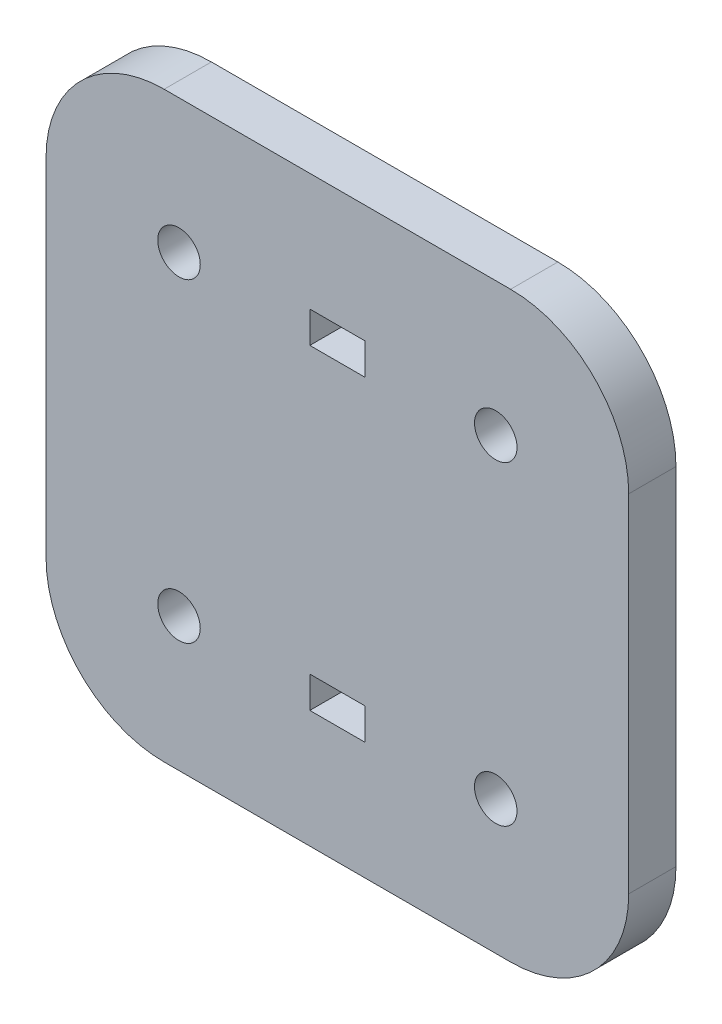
ISO-10303-21;
HEADER;
FILE_DESCRIPTION(('STEP AP214'),'2;1');
FILE_NAME('part.step','',(''),(''),'','','');
FILE_SCHEMA(('AUTOMOTIVE_DESIGN { 1 0 10303 214 1 1 1 1 }'));
ENDSEC;
DATA;
#1=APPLICATION_CONTEXT('core data for automotive mechanical design processes');
#2=APPLICATION_PROTOCOL_DEFINITION('international standard','automotive_design',2000,#1);
#3=PRODUCT_CONTEXT('',#1,'mechanical');
#4=PRODUCT('Part','Part','',(#3));
#5=PRODUCT_RELATED_PRODUCT_CATEGORY('part','',(#4));
#6=PRODUCT_DEFINITION_FORMATION('','',#4);
#7=PRODUCT_DEFINITION_CONTEXT('part definition',#1,'design');
#8=PRODUCT_DEFINITION('design','',#6,#7);
#9=PRODUCT_DEFINITION_SHAPE('','',#8);
#10=(LENGTH_UNIT() NAMED_UNIT(*) SI_UNIT(.MILLI.,.METRE.));
#11=(NAMED_UNIT(*) PLANE_ANGLE_UNIT() SI_UNIT($,.RADIAN.));
#12=(NAMED_UNIT(*) SI_UNIT($,.STERADIAN.) SOLID_ANGLE_UNIT());
#13=UNCERTAINTY_MEASURE_WITH_UNIT(LENGTH_MEASURE(1.E-05),#10,'distance_accuracy_value','');
#14=(GEOMETRIC_REPRESENTATION_CONTEXT(3) GLOBAL_UNCERTAINTY_ASSIGNED_CONTEXT((#13)) GLOBAL_UNIT_ASSIGNED_CONTEXT((#10,
#11,#12)) REPRESENTATION_CONTEXT('',''));
#15=CARTESIAN_POINT('',(0.,0.,0.));
#16=DIRECTION('',(0.,0.,1.));
#17=DIRECTION('',(1.,0.,0.));
#18=AXIS2_PLACEMENT_3D('',#15,#16,#17);
#19=CARTESIAN_POINT('',(-32.0000000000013,-115.404160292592,6.));
#20=DIRECTION('',(0.,0.,-1.));
#21=DIRECTION('',(-1.,0.,0.));
#22=AXIS2_PLACEMENT_3D('',#19,#20,#21);
#23=PLANE('',#22);
#24=CARTESIAN_POINT('',(-30.1133458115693,-113.404160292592,6.));
#25=DIRECTION('',(0.,0.,1.));
#26=DIRECTION('',(1.,0.,0.));
#27=AXIS2_PLACEMENT_3D('',#24,#25,#26);
#28=CIRCLE('',#27,2.70000000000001);
#29=CARTESIAN_POINT('',(-27.4133458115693,-113.404160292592,6.));
#30=VERTEX_POINT('',#29);
#31=EDGE_CURVE('E208',#30,#30,#28,.T.);
#32=ORIENTED_EDGE('',*,*,#31,.F.);
#33=EDGE_LOOP('',(#32));
#34=FACE_BOUND('',#33,.T.);
#35=CARTESIAN_POINT('',(10.1133458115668,-113.404160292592,6.));
#36=DIRECTION('',(0.,0.,1.));
#37=DIRECTION('',(1.,0.,0.));
#38=AXIS2_PLACEMENT_3D('',#35,#36,#37);
#39=CIRCLE('',#38,2.70000000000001);
#40=CARTESIAN_POINT('',(12.8133458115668,-113.404160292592,6.));
#41=VERTEX_POINT('',#40);
#42=EDGE_CURVE('E216',#41,#41,#39,.T.);
#43=ORIENTED_EDGE('',*,*,#42,.F.);
#44=EDGE_LOOP('',(#43));
#45=FACE_BOUND('',#44,.T.);
#46=CARTESIAN_POINT('',(10.113345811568,-73.4041602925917,6.));
#47=DIRECTION('',(0.,0.,1.));
#48=DIRECTION('',(1.,0.,0.));
#49=AXIS2_PLACEMENT_3D('',#46,#47,#48);
#50=CIRCLE('',#49,2.7);
#51=CARTESIAN_POINT('',(12.813345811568,-73.4041602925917,6.));
#52=VERTEX_POINT('',#51);
#53=EDGE_CURVE('E224',#52,#52,#50,.T.);
#54=ORIENTED_EDGE('',*,*,#53,.F.);
#55=EDGE_LOOP('',(#54));
#56=FACE_BOUND('',#55,.T.);
#57=DIRECTION('',(0.,1.,0.));
#58=VECTOR('',#57,1.);
#59=CARTESIAN_POINT('',(-6.50000000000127,-71.3307067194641,6.));
#60=LINE('',#59,#58);
#61=CARTESIAN_POINT('',(-6.50000000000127,-75.3307067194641,6.));
#62=VERTEX_POINT('',#61);
#63=CARTESIAN_POINT('',(-6.50000000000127,-71.3307067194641,6.));
#64=VERTEX_POINT('',#63);
#65=EDGE_CURVE('E235',#62,#64,#60,.T.);
#66=ORIENTED_EDGE('',*,*,#65,.F.);
#67=DIRECTION('',(1.,0.,0.));
#68=VECTOR('',#67,1.);
#69=CARTESIAN_POINT('',(-6.50000000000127,-75.3307067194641,6.));
#70=LINE('',#69,#68);
#71=CARTESIAN_POINT('',(-13.5000000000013,-75.3307067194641,6.));
#72=VERTEX_POINT('',#71);
#73=EDGE_CURVE('E232',#72,#62,#70,.T.);
#74=ORIENTED_EDGE('',*,*,#73,.F.);
#75=DIRECTION('',(0.,-1.,0.));
#76=VECTOR('',#75,1.);
#77=CARTESIAN_POINT('',(-13.5000000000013,-75.3307067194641,6.));
#78=LINE('',#77,#76);
#79=CARTESIAN_POINT('',(-13.5000000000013,-71.3307067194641,6.));
#80=VERTEX_POINT('',#79);
#81=EDGE_CURVE('E242',#80,#72,#78,.T.);
#82=ORIENTED_EDGE('',*,*,#81,.F.);
#83=DIRECTION('',(-1.,0.,0.));
#84=VECTOR('',#83,1.);
#85=CARTESIAN_POINT('',(-13.5000000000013,-71.3307067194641,6.));
#86=LINE('',#85,#84);
#87=EDGE_CURVE('E239',#64,#80,#86,.T.);
#88=ORIENTED_EDGE('',*,*,#87,.F.);
#89=EDGE_LOOP('',(#66,#74,#82,#88));
#90=FACE_BOUND('',#89,.T.);
#91=DIRECTION('',(0.,-1.,0.));
#92=VECTOR('',#91,1.);
#93=CARTESIAN_POINT('',(-47.0000000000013,-71.4041602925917,6.));
#94=LINE('',#93,#92);
#95=CARTESIAN_POINT('',(-47.0000000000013,-71.4041602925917,6.));
#96=VERTEX_POINT('',#95);
#97=CARTESIAN_POINT('',(-47.0000000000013,-115.404160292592,6.));
#98=VERTEX_POINT('',#97);
#99=EDGE_CURVE('E281',#96,#98,#94,.T.);
#100=ORIENTED_EDGE('',*,*,#99,.T.);
#101=CARTESIAN_POINT('',(-32.0000000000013,-115.404160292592,6.));
#102=DIRECTION('',(0.,0.,1.));
#103=DIRECTION('',(-1.,0.,0.));
#104=AXIS2_PLACEMENT_3D('',#101,#102,#103);
#105=CIRCLE('',#104,15.);
#106=CARTESIAN_POINT('',(-32.0000000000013,-130.404160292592,6.));
#107=VERTEX_POINT('',#106);
#108=EDGE_CURVE('E284',#98,#107,#105,.T.);
#109=ORIENTED_EDGE('',*,*,#108,.T.);
#110=DIRECTION('',(1.,0.,0.));
#111=VECTOR('',#110,1.);
#112=CARTESIAN_POINT('',(-32.0000000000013,-130.404160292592,6.));
#113=LINE('',#112,#111);
#114=CARTESIAN_POINT('',(11.9999999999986,-130.404160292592,6.));
#115=VERTEX_POINT('',#114);
#116=EDGE_CURVE('E288',#107,#115,#113,.T.);
#117=ORIENTED_EDGE('',*,*,#116,.T.);
#118=CARTESIAN_POINT('',(11.9999999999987,-115.404160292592,6.));
#119=DIRECTION('',(0.,0.,1.));
#120=DIRECTION('',(-1.,0.,0.));
#121=AXIS2_PLACEMENT_3D('',#118,#119,#120);
#122=CIRCLE('',#121,15.);
#123=CARTESIAN_POINT('',(26.9999999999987,-115.404160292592,6.));
#124=VERTEX_POINT('',#123);
#125=EDGE_CURVE('E291',#115,#124,#122,.T.);
#126=ORIENTED_EDGE('',*,*,#125,.T.);
#127=DIRECTION('',(0.,1.,0.));
#128=VECTOR('',#127,1.);
#129=CARTESIAN_POINT('',(26.9999999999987,-115.404160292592,6.));
#130=LINE('',#129,#128);
#131=CARTESIAN_POINT('',(26.9999999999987,-71.4041602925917,6.));
#132=VERTEX_POINT('',#131);
#133=EDGE_CURVE('E294',#124,#132,#130,.T.);
#134=ORIENTED_EDGE('',*,*,#133,.T.);
#135=CARTESIAN_POINT('',(11.9999999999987,-71.4041602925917,6.));
#136=DIRECTION('',(0.,0.,1.));
#137=DIRECTION('',(-1.,0.,0.));
#138=AXIS2_PLACEMENT_3D('',#135,#136,#137);
#139=CIRCLE('',#138,15.);
#140=CARTESIAN_POINT('',(11.9999999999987,-56.4041602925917,6.));
#141=VERTEX_POINT('',#140);
#142=EDGE_CURVE('E297',#132,#141,#139,.T.);
#143=ORIENTED_EDGE('',*,*,#142,.T.);
#144=DIRECTION('',(-1.,0.,0.));
#145=VECTOR('',#144,1.);
#146=CARTESIAN_POINT('',(11.9999999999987,-56.4041602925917,6.));
#147=LINE('',#146,#145);
#148=CARTESIAN_POINT('',(-32.0000000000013,-56.4041602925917,6.));
#149=VERTEX_POINT('',#148);
#150=EDGE_CURVE('E300',#141,#149,#147,.T.);
#151=ORIENTED_EDGE('',*,*,#150,.T.);
#152=CARTESIAN_POINT('',(-32.0000000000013,-71.4041602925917,6.));
#153=DIRECTION('',(0.,0.,1.));
#154=DIRECTION('',(1.,0.,0.));
#155=AXIS2_PLACEMENT_3D('',#152,#153,#154);
#156=CIRCLE('',#155,15.);
#157=EDGE_CURVE('E303',#149,#96,#156,.T.);
#158=ORIENTED_EDGE('',*,*,#157,.T.);
#159=EDGE_LOOP('',(#100,#109,#117,#126,#134,#143,#151,#158));
#160=FACE_BOUND('',#159,.T.);
#161=CARTESIAN_POINT('',(-30.1133458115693,-73.4041602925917,6.));
#162=DIRECTION('',(0.,0.,1.));
#163=DIRECTION('',(1.,0.,0.));
#164=AXIS2_PLACEMENT_3D('',#161,#162,#163);
#165=CIRCLE('',#164,2.7);
#166=CARTESIAN_POINT('',(-27.4133458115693,-73.4041602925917,6.));
#167=VERTEX_POINT('',#166);
#168=EDGE_CURVE('E273',#167,#167,#165,.T.);
#169=ORIENTED_EDGE('',*,*,#168,.F.);
#170=EDGE_LOOP('',(#169));
#171=FACE_BOUND('',#170,.T.);
#172=DIRECTION('',(1.,0.,0.));
#173=VECTOR('',#172,1.);
#174=CARTESIAN_POINT('',(-13.5000000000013,-115.477613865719,6.));
#175=LINE('',#174,#173);
#176=CARTESIAN_POINT('',(-13.5000000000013,-115.477613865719,6.));
#177=VERTEX_POINT('',#176);
#178=CARTESIAN_POINT('',(-6.50000000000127,-115.477613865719,6.));
#179=VERTEX_POINT('',#178);
#180=EDGE_CURVE('E159',#177,#179,#175,.T.);
#181=ORIENTED_EDGE('',*,*,#180,.F.);
#182=DIRECTION('',(0.,-1.,0.));
#183=VECTOR('',#182,1.);
#184=CARTESIAN_POINT('',(-13.5000000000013,-111.477613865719,6.));
#185=LINE('',#184,#183);
#186=CARTESIAN_POINT('',(-13.5000000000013,-111.477613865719,6.));
#187=VERTEX_POINT('',#186);
#188=EDGE_CURVE('E186',#187,#177,#185,.T.);
#189=ORIENTED_EDGE('',*,*,#188,.F.);
#190=DIRECTION('',(-1.,0.,0.));
#191=VECTOR('',#190,1.);
#192=CARTESIAN_POINT('',(-6.50000000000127,-111.477613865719,6.));
#193=LINE('',#192,#191);
#194=CARTESIAN_POINT('',(-6.50000000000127,-111.477613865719,6.));
#195=VERTEX_POINT('',#194);
#196=EDGE_CURVE('E182',#195,#187,#193,.T.);
#197=ORIENTED_EDGE('',*,*,#196,.F.);
#198=DIRECTION('',(0.,1.,0.));
#199=VECTOR('',#198,1.);
#200=CARTESIAN_POINT('',(-6.50000000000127,-115.477613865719,6.));
#201=LINE('',#200,#199);
#202=EDGE_CURVE('E168',#179,#195,#201,.T.);
#203=ORIENTED_EDGE('',*,*,#202,.F.);
#204=EDGE_LOOP('',(#181,#189,#197,#203));
#205=FACE_BOUND('',#204,.T.);
#206=ADVANCED_FACE('F45',(#34,#45,#56,#90,#160,#171,#205),#23,.F.);
#207=CARTESIAN_POINT('',(-32.0000000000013,-115.404160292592,0.));
#208=DIRECTION('',(0.,0.,-1.));
#209=DIRECTION('',(-1.,0.,0.));
#210=AXIS2_PLACEMENT_3D('',#207,#208,#209);
#211=PLANE('',#210);
#212=CARTESIAN_POINT('',(10.1133458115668,-113.404160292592,0.));
#213=DIRECTION('',(0.,0.,1.));
#214=DIRECTION('',(1.,0.,0.));
#215=AXIS2_PLACEMENT_3D('',#212,#213,#214);
#216=CIRCLE('',#215,2.70000000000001);
#217=CARTESIAN_POINT('',(12.8133458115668,-113.404160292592,0.));
#218=VERTEX_POINT('',#217);
#219=EDGE_CURVE('E212',#218,#218,#216,.T.);
#220=ORIENTED_EDGE('',*,*,#219,.T.);
#221=EDGE_LOOP('',(#220));
#222=FACE_BOUND('',#221,.T.);
#223=DIRECTION('',(1.,0.,0.));
#224=VECTOR('',#223,1.);
#225=CARTESIAN_POINT('',(-10.0000000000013,-75.3307067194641,0.));
#226=LINE('',#225,#224);
#227=CARTESIAN_POINT('',(-13.5000000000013,-75.3307067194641,0.));
#228=VERTEX_POINT('',#227);
#229=CARTESIAN_POINT('',(-6.50000000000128,-75.3307067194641,0.));
#230=VERTEX_POINT('',#229);
#231=EDGE_CURVE('E236',#228,#230,#226,.T.);
#232=ORIENTED_EDGE('',*,*,#231,.T.);
#233=DIRECTION('',(0.,1.,0.));
#234=VECTOR('',#233,1.);
#235=CARTESIAN_POINT('',(-6.50000000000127,-71.3307067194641,0.));
#236=LINE('',#235,#234);
#237=CARTESIAN_POINT('',(-6.50000000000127,-71.3307067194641,0.));
#238=VERTEX_POINT('',#237);
#239=EDGE_CURVE('E228',#230,#238,#236,.T.);
#240=ORIENTED_EDGE('',*,*,#239,.T.);
#241=DIRECTION('',(-1.,0.,0.));
#242=VECTOR('',#241,1.);
#243=CARTESIAN_POINT('',(-13.5000000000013,-71.3307067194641,0.));
#244=LINE('',#243,#242);
#245=CARTESIAN_POINT('',(-13.5000000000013,-71.3307067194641,0.));
#246=VERTEX_POINT('',#245);
#247=EDGE_CURVE('E250',#238,#246,#244,.T.);
#248=ORIENTED_EDGE('',*,*,#247,.T.);
#249=DIRECTION('',(0.,-1.,0.));
#250=VECTOR('',#249,1.);
#251=CARTESIAN_POINT('',(-13.5000000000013,-75.3307067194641,0.));
#252=LINE('',#251,#250);
#253=EDGE_CURVE('E254',#246,#228,#252,.T.);
#254=ORIENTED_EDGE('',*,*,#253,.T.);
#255=EDGE_LOOP('',(#232,#240,#248,#254));
#256=FACE_BOUND('',#255,.T.);
#257=CARTESIAN_POINT('',(-30.1133458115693,-73.4041602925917,0.));
#258=DIRECTION('',(0.,0.,1.));
#259=DIRECTION('',(1.,0.,0.));
#260=AXIS2_PLACEMENT_3D('',#257,#258,#259);
#261=CIRCLE('',#260,2.7);
#262=CARTESIAN_POINT('',(-27.4133458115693,-73.4041602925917,0.));
#263=VERTEX_POINT('',#262);
#264=EDGE_CURVE('E272',#263,#263,#261,.T.);
#265=ORIENTED_EDGE('',*,*,#264,.T.);
#266=EDGE_LOOP('',(#265));
#267=FACE_BOUND('',#266,.T.);
#268=DIRECTION('',(0.,-1.,0.));
#269=VECTOR('',#268,1.);
#270=CARTESIAN_POINT('',(-47.0000000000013,-93.4041602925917,0.));
#271=LINE('',#270,#269);
#272=CARTESIAN_POINT('',(-47.0000000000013,-71.4041602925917,0.));
#273=VERTEX_POINT('',#272);
#274=CARTESIAN_POINT('',(-47.0000000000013,-115.404160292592,0.));
#275=VERTEX_POINT('',#274);
#276=EDGE_CURVE('E277',#273,#275,#271,.T.);
#277=ORIENTED_EDGE('',*,*,#276,.F.);
#278=CARTESIAN_POINT('',(-32.0000000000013,-71.4041602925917,0.));
#279=DIRECTION('',(0.,0.,1.));
#280=DIRECTION('',(1.,0.,0.));
#281=AXIS2_PLACEMENT_3D('',#278,#279,#280);
#282=CIRCLE('',#281,15.);
#283=CARTESIAN_POINT('',(-32.0000000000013,-56.4041602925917,0.));
#284=VERTEX_POINT('',#283);
#285=EDGE_CURVE('E285',#284,#273,#282,.T.);
#286=ORIENTED_EDGE('',*,*,#285,.F.);
#287=DIRECTION('',(-1.,0.,0.));
#288=VECTOR('',#287,1.);
#289=CARTESIAN_POINT('',(11.9999999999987,-56.4041602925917,0.));
#290=LINE('',#289,#288);
#291=CARTESIAN_POINT('',(11.9999999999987,-56.4041602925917,0.));
#292=VERTEX_POINT('',#291);
#293=EDGE_CURVE('E324',#292,#284,#290,.T.);
#294=ORIENTED_EDGE('',*,*,#293,.F.);
#295=CARTESIAN_POINT('',(11.9999999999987,-71.4041602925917,0.));
#296=DIRECTION('',(0.,0.,1.));
#297=DIRECTION('',(-1.,0.,0.));
#298=AXIS2_PLACEMENT_3D('',#295,#296,#297);
#299=CIRCLE('',#298,15.);
#300=CARTESIAN_POINT('',(26.9999999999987,-71.4041602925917,0.));
#301=VERTEX_POINT('',#300);
#302=EDGE_CURVE('E321',#301,#292,#299,.T.);
#303=ORIENTED_EDGE('',*,*,#302,.F.);
#304=DIRECTION('',(0.,1.,0.));
#305=VECTOR('',#304,1.);
#306=CARTESIAN_POINT('',(26.9999999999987,-115.404160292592,0.));
#307=LINE('',#306,#305);
#308=CARTESIAN_POINT('',(26.9999999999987,-115.404160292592,0.));
#309=VERTEX_POINT('',#308);
#310=EDGE_CURVE('E318',#309,#301,#307,.T.);
#311=ORIENTED_EDGE('',*,*,#310,.F.);
#312=CARTESIAN_POINT('',(11.9999999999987,-115.404160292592,0.));
#313=DIRECTION('',(0.,0.,1.));
#314=DIRECTION('',(-1.,0.,0.));
#315=AXIS2_PLACEMENT_3D('',#312,#313,#314);
#316=CIRCLE('',#315,15.);
#317=CARTESIAN_POINT('',(11.9999999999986,-130.404160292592,0.));
#318=VERTEX_POINT('',#317);
#319=EDGE_CURVE('E315',#318,#309,#316,.T.);
#320=ORIENTED_EDGE('',*,*,#319,.F.);
#321=DIRECTION('',(1.,0.,0.));
#322=VECTOR('',#321,1.);
#323=CARTESIAN_POINT('',(-32.0000000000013,-130.404160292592,0.));
#324=LINE('',#323,#322);
#325=CARTESIAN_POINT('',(-32.0000000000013,-130.404160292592,0.));
#326=VERTEX_POINT('',#325);
#327=EDGE_CURVE('E312',#326,#318,#324,.T.);
#328=ORIENTED_EDGE('',*,*,#327,.F.);
#329=CARTESIAN_POINT('',(-32.0000000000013,-115.404160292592,0.));
#330=DIRECTION('',(0.,0.,1.));
#331=DIRECTION('',(-1.,0.,0.));
#332=AXIS2_PLACEMENT_3D('',#329,#330,#331);
#333=CIRCLE('',#332,15.);
#334=EDGE_CURVE('E309',#275,#326,#333,.T.);
#335=ORIENTED_EDGE('',*,*,#334,.F.);
#336=EDGE_LOOP('',(#277,#286,#294,#303,#311,#320,#328,#335));
#337=FACE_BOUND('',#336,.T.);
#338=CARTESIAN_POINT('',(10.113345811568,-73.4041602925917,0.));
#339=DIRECTION('',(0.,0.,1.));
#340=DIRECTION('',(1.,0.,0.));
#341=AXIS2_PLACEMENT_3D('',#338,#339,#340);
#342=CIRCLE('',#341,2.7);
#343=CARTESIAN_POINT('',(12.813345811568,-73.4041602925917,0.));
#344=VERTEX_POINT('',#343);
#345=EDGE_CURVE('E220',#344,#344,#342,.T.);
#346=ORIENTED_EDGE('',*,*,#345,.T.);
#347=EDGE_LOOP('',(#346));
#348=FACE_BOUND('',#347,.T.);
#349=CARTESIAN_POINT('',(-30.1133458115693,-113.404160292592,0.));
#350=DIRECTION('',(0.,0.,1.));
#351=DIRECTION('',(1.,0.,0.));
#352=AXIS2_PLACEMENT_3D('',#349,#350,#351);
#353=CIRCLE('',#352,2.70000000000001);
#354=CARTESIAN_POINT('',(-27.4133458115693,-113.404160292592,0.));
#355=VERTEX_POINT('',#354);
#356=EDGE_CURVE('E178',#355,#355,#353,.T.);
#357=ORIENTED_EDGE('',*,*,#356,.T.);
#358=EDGE_LOOP('',(#357));
#359=FACE_BOUND('',#358,.T.);
#360=DIRECTION('',(0.,-1.,0.));
#361=VECTOR('',#360,1.);
#362=CARTESIAN_POINT('',(-13.5000000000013,-111.477613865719,0.));
#363=LINE('',#362,#361);
#364=CARTESIAN_POINT('',(-13.5000000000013,-111.477613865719,0.));
#365=VERTEX_POINT('',#364);
#366=CARTESIAN_POINT('',(-13.5000000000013,-115.477613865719,0.));
#367=VERTEX_POINT('',#366);
#368=EDGE_CURVE('E169',#365,#367,#363,.T.);
#369=ORIENTED_EDGE('',*,*,#368,.T.);
#370=DIRECTION('',(1.,0.,0.));
#371=VECTOR('',#370,1.);
#372=CARTESIAN_POINT('',(-13.5000000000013,-115.477613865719,0.));
#373=LINE('',#372,#371);
#374=CARTESIAN_POINT('',(-6.50000000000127,-115.477613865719,0.));
#375=VERTEX_POINT('',#374);
#376=EDGE_CURVE('E69',#367,#375,#373,.T.);
#377=ORIENTED_EDGE('',*,*,#376,.T.);
#378=DIRECTION('',(0.,1.,0.));
#379=VECTOR('',#378,1.);
#380=CARTESIAN_POINT('',(-6.50000000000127,-115.477613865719,0.));
#381=LINE('',#380,#379);
#382=CARTESIAN_POINT('',(-6.50000000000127,-111.477613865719,0.));
#383=VERTEX_POINT('',#382);
#384=EDGE_CURVE('E176',#375,#383,#381,.T.);
#385=ORIENTED_EDGE('',*,*,#384,.T.);
#386=DIRECTION('',(-1.,0.,0.));
#387=VECTOR('',#386,1.);
#388=CARTESIAN_POINT('',(-10.0000000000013,-111.477613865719,0.));
#389=LINE('',#388,#387);
#390=EDGE_CURVE('E195',#383,#365,#389,.T.);
#391=ORIENTED_EDGE('',*,*,#390,.T.);
#392=EDGE_LOOP('',(#369,#377,#385,#391));
#393=FACE_BOUND('',#392,.T.);
#394=ADVANCED_FACE('F365',(#222,#256,#267,#337,#348,#359,#393),#211,.T.);
#395=CARTESIAN_POINT('',(-47.0000000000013,-93.4041602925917,6.));
#396=DIRECTION('',(1.,0.,0.));
#397=DIRECTION('',(0.,1.,0.));
#398=AXIS2_PLACEMENT_3D('',#395,#396,#397);
#399=PLANE('',#398);
#400=ORIENTED_EDGE('',*,*,#276,.T.);
#401=DIRECTION('',(0.,0.,-1.));
#402=VECTOR('',#401,1.);
#403=CARTESIAN_POINT('',(-47.0000000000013,-115.404160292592,6.));
#404=LINE('',#403,#402);
#405=EDGE_CURVE('E11',#98,#275,#404,.T.);
#406=ORIENTED_EDGE('',*,*,#405,.F.);
#407=ORIENTED_EDGE('',*,*,#99,.F.);
#408=DIRECTION('',(0.,0.,-1.));
#409=VECTOR('',#408,1.);
#410=CARTESIAN_POINT('',(-47.0000000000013,-71.4041602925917,6.));
#411=LINE('',#410,#409);
#412=EDGE_CURVE('E306',#96,#273,#411,.T.);
#413=ORIENTED_EDGE('',*,*,#412,.T.);
#414=EDGE_LOOP('',(#400,#406,#407,#413));
#415=FACE_BOUND('',#414,.T.);
#416=ADVANCED_FACE('F47',(#415),#399,.F.);
#417=CARTESIAN_POINT('',(-32.0000000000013,-115.404160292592,6.));
#418=DIRECTION('',(0.,0.,-1.));
#419=DIRECTION('',(-1.,0.,0.));
#420=AXIS2_PLACEMENT_3D('',#417,#418,#419);
#421=CYLINDRICAL_SURFACE('',#420,15.);
#422=ORIENTED_EDGE('',*,*,#334,.T.);
#423=DIRECTION('',(0.,0.,-1.));
#424=VECTOR('',#423,1.);
#425=CARTESIAN_POINT('',(-32.0000000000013,-130.404160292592,6.));
#426=LINE('',#425,#424);
#427=EDGE_CURVE('E54',#107,#326,#426,.T.);
#428=ORIENTED_EDGE('',*,*,#427,.F.);
#429=ORIENTED_EDGE('',*,*,#108,.F.);
#430=ORIENTED_EDGE('',*,*,#405,.T.);
#431=EDGE_LOOP('',(#422,#428,#429,#430));
#432=FACE_BOUND('',#431,.T.);
#433=ADVANCED_FACE('F383',(#432),#421,.T.);
#434=CARTESIAN_POINT('',(-32.0000000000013,-130.404160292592,6.));
#435=DIRECTION('',(0.,1.,0.));
#436=DIRECTION('',(-1.,0.,0.));
#437=AXIS2_PLACEMENT_3D('',#434,#435,#436);
#438=PLANE('',#437);
#439=ORIENTED_EDGE('',*,*,#327,.T.);
#440=DIRECTION('',(0.,0.,-1.));
#441=VECTOR('',#440,1.);
#442=CARTESIAN_POINT('',(11.9999999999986,-130.404160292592,6.));
#443=LINE('',#442,#441);
#444=EDGE_CURVE('E349',#115,#318,#443,.T.);
#445=ORIENTED_EDGE('',*,*,#444,.F.);
#446=ORIENTED_EDGE('',*,*,#116,.F.);
#447=ORIENTED_EDGE('',*,*,#427,.T.);
#448=EDGE_LOOP('',(#439,#445,#446,#447));
#449=FACE_BOUND('',#448,.T.);
#450=ADVANCED_FACE('F358',(#449),#438,.F.);
#451=CARTESIAN_POINT('',(11.9999999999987,-115.404160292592,6.));
#452=DIRECTION('',(0.,0.,-1.));
#453=DIRECTION('',(-1.,0.,0.));
#454=AXIS2_PLACEMENT_3D('',#451,#452,#453);
#455=CYLINDRICAL_SURFACE('',#454,15.);
#456=ORIENTED_EDGE('',*,*,#319,.T.);
#457=DIRECTION('',(0.,0.,-1.));
#458=VECTOR('',#457,1.);
#459=CARTESIAN_POINT('',(26.9999999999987,-115.404160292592,6.));
#460=LINE('',#459,#458);
#461=EDGE_CURVE('E345',#124,#309,#460,.T.);
#462=ORIENTED_EDGE('',*,*,#461,.F.);
#463=ORIENTED_EDGE('',*,*,#125,.F.);
#464=ORIENTED_EDGE('',*,*,#444,.T.);
#465=EDGE_LOOP('',(#456,#462,#463,#464));
#466=FACE_BOUND('',#465,.T.);
#467=ADVANCED_FACE('F371',(#466),#455,.T.);
#468=CARTESIAN_POINT('',(26.9999999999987,-115.404160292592,6.));
#469=DIRECTION('',(-1.,0.,0.));
#470=DIRECTION('',(0.,-1.,0.));
#471=AXIS2_PLACEMENT_3D('',#468,#469,#470);
#472=PLANE('',#471);
#473=ORIENTED_EDGE('',*,*,#310,.T.);
#474=DIRECTION('',(0.,0.,-1.));
#475=VECTOR('',#474,1.);
#476=CARTESIAN_POINT('',(26.9999999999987,-71.4041602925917,6.));
#477=LINE('',#476,#475);
#478=EDGE_CURVE('E341',#132,#301,#477,.T.);
#479=ORIENTED_EDGE('',*,*,#478,.F.);
#480=ORIENTED_EDGE('',*,*,#133,.F.);
#481=ORIENTED_EDGE('',*,*,#461,.T.);
#482=EDGE_LOOP('',(#473,#479,#480,#481));
#483=FACE_BOUND('',#482,.T.);
#484=ADVANCED_FACE('F375',(#483),#472,.F.);
#485=CARTESIAN_POINT('',(11.9999999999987,-71.4041602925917,6.));
#486=DIRECTION('',(0.,0.,-1.));
#487=DIRECTION('',(-1.,0.,0.));
#488=AXIS2_PLACEMENT_3D('',#485,#486,#487);
#489=CYLINDRICAL_SURFACE('',#488,15.);
#490=ORIENTED_EDGE('',*,*,#302,.T.);
#491=DIRECTION('',(0.,0.,-1.));
#492=VECTOR('',#491,1.);
#493=CARTESIAN_POINT('',(11.9999999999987,-56.4041602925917,6.));
#494=LINE('',#493,#492);
#495=EDGE_CURVE('E337',#141,#292,#494,.T.);
#496=ORIENTED_EDGE('',*,*,#495,.F.);
#497=ORIENTED_EDGE('',*,*,#142,.F.);
#498=ORIENTED_EDGE('',*,*,#478,.T.);
#499=EDGE_LOOP('',(#490,#496,#497,#498));
#500=FACE_BOUND('',#499,.T.);
#501=ADVANCED_FACE('F396',(#500),#489,.T.);
#502=CARTESIAN_POINT('',(11.9999999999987,-56.4041602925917,6.));
#503=DIRECTION('',(0.,-1.,0.));
#504=DIRECTION('',(0.,0.,-1.));
#505=AXIS2_PLACEMENT_3D('',#502,#503,#504);
#506=PLANE('',#505);
#507=ORIENTED_EDGE('',*,*,#293,.T.);
#508=DIRECTION('',(0.,0.,-1.));
#509=VECTOR('',#508,1.);
#510=CARTESIAN_POINT('',(-32.0000000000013,-56.4041602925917,6.));
#511=LINE('',#510,#509);
#512=EDGE_CURVE('E333',#149,#284,#511,.T.);
#513=ORIENTED_EDGE('',*,*,#512,.F.);
#514=ORIENTED_EDGE('',*,*,#150,.F.);
#515=ORIENTED_EDGE('',*,*,#495,.T.);
#516=EDGE_LOOP('',(#507,#513,#514,#515));
#517=FACE_BOUND('',#516,.T.);
#518=ADVANCED_FACE('F394',(#517),#506,.F.);
#519=CARTESIAN_POINT('',(-32.0000000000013,-71.4041602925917,6.));
#520=DIRECTION('',(0.,0.,-1.));
#521=DIRECTION('',(-1.,0.,0.));
#522=AXIS2_PLACEMENT_3D('',#519,#520,#521);
#523=CYLINDRICAL_SURFACE('',#522,15.);
#524=ORIENTED_EDGE('',*,*,#285,.T.);
#525=ORIENTED_EDGE('',*,*,#412,.F.);
#526=ORIENTED_EDGE('',*,*,#157,.F.);
#527=ORIENTED_EDGE('',*,*,#512,.T.);
#528=EDGE_LOOP('',(#524,#525,#526,#527));
#529=FACE_BOUND('',#528,.T.);
#530=ADVANCED_FACE('F389',(#529),#523,.T.);
#531=CARTESIAN_POINT('',(-30.1133458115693,-73.4041602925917,6.));
#532=DIRECTION('',(0.,0.,-1.));
#533=DIRECTION('',(-1.,0.,0.));
#534=AXIS2_PLACEMENT_3D('',#531,#532,#533);
#535=CYLINDRICAL_SURFACE('',#534,2.7);
#536=ORIENTED_EDGE('',*,*,#168,.T.);
#537=EDGE_LOOP('',(#536));
#538=FACE_BOUND('',#537,.T.);
#539=ORIENTED_EDGE('',*,*,#264,.F.);
#540=EDGE_LOOP('',(#539));
#541=FACE_BOUND('',#540,.T.);
#542=ADVANCED_FACE('F416',(#538,#541),#535,.F.);
#543=CARTESIAN_POINT('',(-6.50000000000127,-71.3307067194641,6.));
#544=DIRECTION('',(-1.,0.,0.));
#545=DIRECTION('',(0.,0.,1.));
#546=AXIS2_PLACEMENT_3D('',#543,#544,#545);
#547=PLANE('',#546);
#548=ORIENTED_EDGE('',*,*,#239,.F.);
#549=DIRECTION('',(0.,0.,-1.));
#550=VECTOR('',#549,1.);
#551=CARTESIAN_POINT('',(-6.50000000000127,-75.3307067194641,6.));
#552=LINE('',#551,#550);
#553=EDGE_CURVE('E269',#62,#230,#552,.T.);
#554=ORIENTED_EDGE('',*,*,#553,.F.);
#555=ORIENTED_EDGE('',*,*,#65,.T.);
#556=DIRECTION('',(0.,0.,-1.));
#557=VECTOR('',#556,1.);
#558=CARTESIAN_POINT('',(-6.50000000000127,-71.3307067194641,6.));
#559=LINE('',#558,#557);
#560=EDGE_CURVE('E266',#64,#238,#559,.T.);
#561=ORIENTED_EDGE('',*,*,#560,.T.);
#562=EDGE_LOOP('',(#548,#554,#555,#561));
#563=FACE_BOUND('',#562,.T.);
#564=ADVANCED_FACE('F423',(#563),#547,.T.);
#565=CARTESIAN_POINT('',(-13.5000000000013,-71.3307067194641,6.));
#566=DIRECTION('',(0.,-1.,0.));
#567=DIRECTION('',(0.,0.,-1.));
#568=AXIS2_PLACEMENT_3D('',#565,#566,#567);
#569=PLANE('',#568);
#570=ORIENTED_EDGE('',*,*,#247,.F.);
#571=ORIENTED_EDGE('',*,*,#560,.F.);
#572=ORIENTED_EDGE('',*,*,#87,.T.);
#573=DIRECTION('',(0.,0.,-1.));
#574=VECTOR('',#573,1.);
#575=CARTESIAN_POINT('',(-13.5000000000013,-71.3307067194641,6.));
#576=LINE('',#575,#574);
#577=EDGE_CURVE('E263',#80,#246,#576,.T.);
#578=ORIENTED_EDGE('',*,*,#577,.T.);
#579=EDGE_LOOP('',(#570,#571,#572,#578));
#580=FACE_BOUND('',#579,.T.);
#581=ADVANCED_FACE('F428',(#580),#569,.T.);
#582=CARTESIAN_POINT('',(-13.5000000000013,-75.3307067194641,6.));
#583=DIRECTION('',(1.,0.,0.));
#584=DIRECTION('',(0.,0.,-1.));
#585=AXIS2_PLACEMENT_3D('',#582,#583,#584);
#586=PLANE('',#585);
#587=ORIENTED_EDGE('',*,*,#253,.F.);
#588=ORIENTED_EDGE('',*,*,#577,.F.);
#589=ORIENTED_EDGE('',*,*,#81,.T.);
#590=DIRECTION('',(0.,0.,-1.));
#591=VECTOR('',#590,1.);
#592=CARTESIAN_POINT('',(-13.5000000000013,-75.3307067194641,6.));
#593=LINE('',#592,#591);
#594=EDGE_CURVE('E246',#72,#228,#593,.T.);
#595=ORIENTED_EDGE('',*,*,#594,.T.);
#596=EDGE_LOOP('',(#587,#588,#589,#595));
#597=FACE_BOUND('',#596,.T.);
#598=ADVANCED_FACE('F437',(#597),#586,.T.);
#599=CARTESIAN_POINT('',(-10.0000000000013,-75.3307067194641,6.));
#600=DIRECTION('',(0.,1.,0.));
#601=DIRECTION('',(0.,0.,1.));
#602=AXIS2_PLACEMENT_3D('',#599,#600,#601);
#603=PLANE('',#602);
#604=ORIENTED_EDGE('',*,*,#231,.F.);
#605=ORIENTED_EDGE('',*,*,#594,.F.);
#606=ORIENTED_EDGE('',*,*,#73,.T.);
#607=ORIENTED_EDGE('',*,*,#553,.T.);
#608=EDGE_LOOP('',(#604,#605,#606,#607));
#609=FACE_BOUND('',#608,.T.);
#610=ADVANCED_FACE('F444',(#609),#603,.T.);
#611=CARTESIAN_POINT('',(10.113345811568,-73.4041602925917,6.));
#612=DIRECTION('',(0.,0.,-1.));
#613=DIRECTION('',(-1.,0.,0.));
#614=AXIS2_PLACEMENT_3D('',#611,#612,#613);
#615=CYLINDRICAL_SURFACE('',#614,2.7);
#616=ORIENTED_EDGE('',*,*,#53,.T.);
#617=EDGE_LOOP('',(#616));
#618=FACE_BOUND('',#617,.T.);
#619=ORIENTED_EDGE('',*,*,#345,.F.);
#620=EDGE_LOOP('',(#619));
#621=FACE_BOUND('',#620,.T.);
#622=ADVANCED_FACE('F448',(#618,#621),#615,.F.);
#623=CARTESIAN_POINT('',(10.1133458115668,-113.404160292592,6.));
#624=DIRECTION('',(0.,0.,-1.));
#625=DIRECTION('',(-1.,0.,0.));
#626=AXIS2_PLACEMENT_3D('',#623,#624,#625);
#627=CYLINDRICAL_SURFACE('',#626,2.70000000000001);
#628=ORIENTED_EDGE('',*,*,#42,.T.);
#629=EDGE_LOOP('',(#628));
#630=FACE_BOUND('',#629,.T.);
#631=ORIENTED_EDGE('',*,*,#219,.F.);
#632=EDGE_LOOP('',(#631));
#633=FACE_BOUND('',#632,.T.);
#634=ADVANCED_FACE('F452',(#630,#633),#627,.F.);
#635=CARTESIAN_POINT('',(-30.1133458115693,-113.404160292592,6.));
#636=DIRECTION('',(0.,0.,-1.));
#637=DIRECTION('',(-1.,0.,0.));
#638=AXIS2_PLACEMENT_3D('',#635,#636,#637);
#639=CYLINDRICAL_SURFACE('',#638,2.70000000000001);
#640=ORIENTED_EDGE('',*,*,#31,.T.);
#641=EDGE_LOOP('',(#640));
#642=FACE_BOUND('',#641,.T.);
#643=ORIENTED_EDGE('',*,*,#356,.F.);
#644=EDGE_LOOP('',(#643));
#645=FACE_BOUND('',#644,.T.);
#646=ADVANCED_FACE('F456',(#642,#645),#639,.F.);
#647=CARTESIAN_POINT('',(-13.5000000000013,-115.477613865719,6.));
#648=DIRECTION('',(0.,1.,0.));
#649=DIRECTION('',(0.,0.,1.));
#650=AXIS2_PLACEMENT_3D('',#647,#648,#649);
#651=PLANE('',#650);
#652=ORIENTED_EDGE('',*,*,#376,.F.);
#653=DIRECTION('',(0.,0.,-1.));
#654=VECTOR('',#653,1.);
#655=CARTESIAN_POINT('',(-13.5000000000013,-115.477613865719,6.));
#656=LINE('',#655,#654);
#657=EDGE_CURVE('E163',#177,#367,#656,.T.);
#658=ORIENTED_EDGE('',*,*,#657,.F.);
#659=ORIENTED_EDGE('',*,*,#180,.T.);
#660=DIRECTION('',(0.,0.,-1.));
#661=VECTOR('',#660,1.);
#662=CARTESIAN_POINT('',(-6.50000000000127,-115.477613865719,6.));
#663=LINE('',#662,#661);
#664=EDGE_CURVE('E162',#179,#375,#663,.T.);
#665=ORIENTED_EDGE('',*,*,#664,.T.);
#666=EDGE_LOOP('',(#652,#658,#659,#665));
#667=FACE_BOUND('',#666,.T.);
#668=ADVANCED_FACE('F161',(#667),#651,.T.);
#669=CARTESIAN_POINT('',(-6.50000000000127,-115.477613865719,6.));
#670=DIRECTION('',(-1.,0.,0.));
#671=DIRECTION('',(0.,0.,1.));
#672=AXIS2_PLACEMENT_3D('',#669,#670,#671);
#673=PLANE('',#672);
#674=ORIENTED_EDGE('',*,*,#384,.F.);
#675=ORIENTED_EDGE('',*,*,#664,.F.);
#676=ORIENTED_EDGE('',*,*,#202,.T.);
#677=DIRECTION('',(0.,0.,-1.));
#678=VECTOR('',#677,1.);
#679=CARTESIAN_POINT('',(-6.50000000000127,-111.477613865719,6.));
#680=LINE('',#679,#678);
#681=EDGE_CURVE('E179',#195,#383,#680,.T.);
#682=ORIENTED_EDGE('',*,*,#681,.T.);
#683=EDGE_LOOP('',(#674,#675,#676,#682));
#684=FACE_BOUND('',#683,.T.);
#685=ADVANCED_FACE('F172',(#684),#673,.T.);
#686=CARTESIAN_POINT('',(-10.0000000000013,-111.477613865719,6.));
#687=DIRECTION('',(0.,-1.,0.));
#688=DIRECTION('',(0.,0.,-1.));
#689=AXIS2_PLACEMENT_3D('',#686,#687,#688);
#690=PLANE('',#689);
#691=ORIENTED_EDGE('',*,*,#390,.F.);
#692=ORIENTED_EDGE('',*,*,#681,.F.);
#693=ORIENTED_EDGE('',*,*,#196,.T.);
#694=DIRECTION('',(0.,0.,-1.));
#695=VECTOR('',#694,1.);
#696=CARTESIAN_POINT('',(-13.5000000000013,-111.477613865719,6.));
#697=LINE('',#696,#695);
#698=EDGE_CURVE('E61',#187,#365,#697,.T.);
#699=ORIENTED_EDGE('',*,*,#698,.T.);
#700=EDGE_LOOP('',(#691,#692,#693,#699));
#701=FACE_BOUND('',#700,.T.);
#702=ADVANCED_FACE('F465',(#701),#690,.T.);
#703=CARTESIAN_POINT('',(-13.5000000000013,-111.477613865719,6.));
#704=DIRECTION('',(1.,0.,0.));
#705=DIRECTION('',(0.,0.,-1.));
#706=AXIS2_PLACEMENT_3D('',#703,#704,#705);
#707=PLANE('',#706);
#708=ORIENTED_EDGE('',*,*,#368,.F.);
#709=ORIENTED_EDGE('',*,*,#698,.F.);
#710=ORIENTED_EDGE('',*,*,#188,.T.);
#711=ORIENTED_EDGE('',*,*,#657,.T.);
#712=EDGE_LOOP('',(#708,#709,#710,#711));
#713=FACE_BOUND('',#712,.T.);
#714=ADVANCED_FACE('F468',(#713),#707,.T.);
#715=CLOSED_SHELL('',(#206,#394,#416,#433,#450,#467,#484,#501,#518,#530,#542,#564,#581,#598,
#610,#622,#634,#646,#668,#685,#702,#714));
#716=MANIFOLD_SOLID_BREP('B2',#715);
#717=ADVANCED_BREP_SHAPE_REPRESENTATION('',(#18,#716),#14);
#718=SHAPE_DEFINITION_REPRESENTATION(#9,#717);
ENDSEC;
END-ISO-10303-21;
